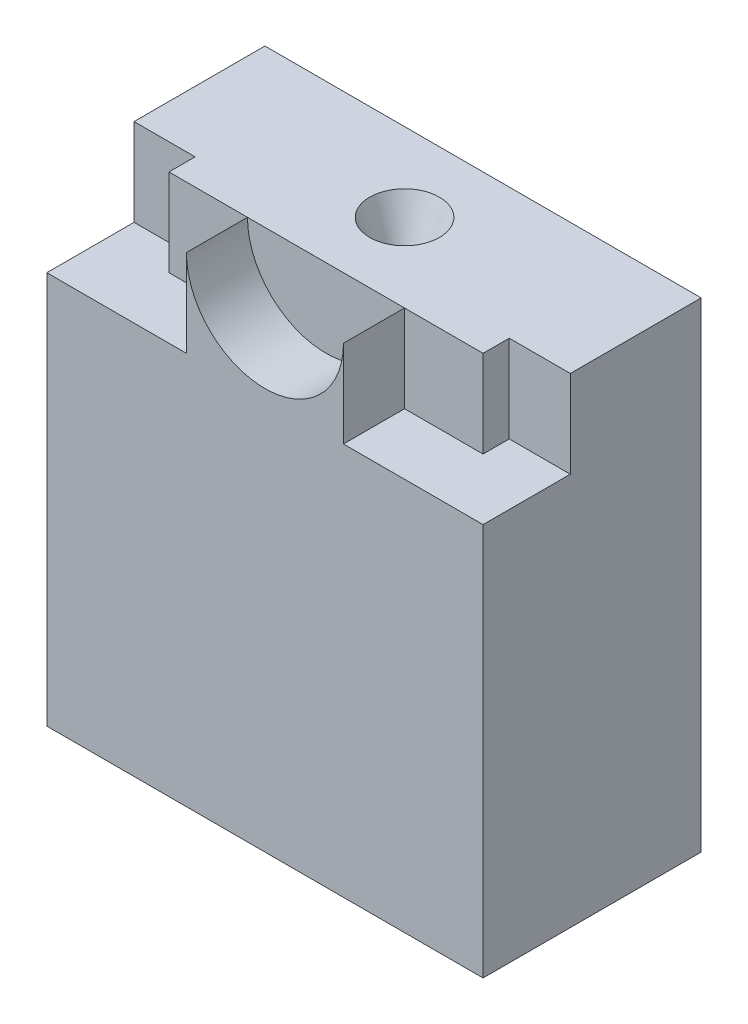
ISO-10303-21;
HEADER;
FILE_DESCRIPTION(('STEP AP214'),'2;1');
FILE_NAME('part.step','',(''),(''),'','','');
FILE_SCHEMA(('AUTOMOTIVE_DESIGN { 1 0 10303 214 1 1 1 1 }'));
ENDSEC;
DATA;
#1=APPLICATION_CONTEXT('core data for automotive mechanical design processes');
#2=APPLICATION_PROTOCOL_DEFINITION('international standard','automotive_design',2000,#1);
#3=PRODUCT_CONTEXT('',#1,'mechanical');
#4=PRODUCT('Part','Part','',(#3));
#5=PRODUCT_RELATED_PRODUCT_CATEGORY('part','',(#4));
#6=PRODUCT_DEFINITION_FORMATION('','',#4);
#7=PRODUCT_DEFINITION_CONTEXT('part definition',#1,'design');
#8=PRODUCT_DEFINITION('design','',#6,#7);
#9=PRODUCT_DEFINITION_SHAPE('','',#8);
#10=(LENGTH_UNIT() NAMED_UNIT(*) SI_UNIT(.MILLI.,.METRE.));
#11=(NAMED_UNIT(*) PLANE_ANGLE_UNIT() SI_UNIT($,.RADIAN.));
#12=(NAMED_UNIT(*) SI_UNIT($,.STERADIAN.) SOLID_ANGLE_UNIT());
#13=UNCERTAINTY_MEASURE_WITH_UNIT(LENGTH_MEASURE(1.E-05),#10,'distance_accuracy_value','');
#14=(GEOMETRIC_REPRESENTATION_CONTEXT(3) GLOBAL_UNCERTAINTY_ASSIGNED_CONTEXT((#13)) GLOBAL_UNIT_ASSIGNED_CONTEXT((#10,
#11,#12)) REPRESENTATION_CONTEXT('',''));
#15=CARTESIAN_POINT('',(0.,0.,0.));
#16=DIRECTION('',(0.,0.,1.));
#17=DIRECTION('',(1.,0.,0.));
#18=AXIS2_PLACEMENT_3D('',#15,#16,#17);
#19=CARTESIAN_POINT('',(-25.,55.,12.5));
#20=DIRECTION('',(0.,1.,0.));
#21=DIRECTION('',(0.,0.,1.));
#22=AXIS2_PLACEMENT_3D('',#19,#20,#21);
#23=PLANE('',#22);
#24=CARTESIAN_POINT('',(0.,55.,-3.5));
#25=DIRECTION('',(0.,-1.,0.));
#26=DIRECTION('',(0.,0.,-1.));
#27=AXIS2_PLACEMENT_3D('',#24,#25,#26);
#28=CIRCLE('',#27,4.);
#29=CARTESIAN_POINT('',(0.,55.,-7.5));
#30=VERTEX_POINT('',#29);
#31=EDGE_CURVE('E239',#30,#30,#28,.T.);
#32=ORIENTED_EDGE('',*,*,#31,.T.);
#33=EDGE_LOOP('',(#32));
#34=FACE_BOUND('',#33,.T.);
#35=DIRECTION('',(-1.,0.,0.));
#36=VECTOR('',#35,1.);
#37=CARTESIAN_POINT('',(-9.,55.,5.5));
#38=LINE('',#37,#36);
#39=CARTESIAN_POINT('',(-9.,55.,5.5));
#40=VERTEX_POINT('',#39);
#41=CARTESIAN_POINT('',(-18.,55.,5.5));
#42=VERTEX_POINT('',#41);
#43=EDGE_CURVE('E191',#40,#42,#38,.T.);
#44=ORIENTED_EDGE('',*,*,#43,.F.);
#45=DIRECTION('',(1.,0.,0.));
#46=VECTOR('',#45,1.);
#47=CARTESIAN_POINT('',(-25.,55.,5.5));
#48=LINE('',#47,#46);
#49=CARTESIAN_POINT('',(9.,55.,5.5));
#50=VERTEX_POINT('',#49);
#51=EDGE_CURVE('E234',#40,#50,#48,.T.);
#52=ORIENTED_EDGE('',*,*,#51,.T.);
#53=DIRECTION('',(-1.,0.,0.));
#54=VECTOR('',#53,1.);
#55=CARTESIAN_POINT('',(9.,55.,5.5));
#56=LINE('',#55,#54);
#57=CARTESIAN_POINT('',(18.,55.,5.5));
#58=VERTEX_POINT('',#57);
#59=EDGE_CURVE('E259',#58,#50,#56,.T.);
#60=ORIENTED_EDGE('',*,*,#59,.F.);
#61=DIRECTION('',(0.,0.,1.));
#62=VECTOR('',#61,1.);
#63=CARTESIAN_POINT('',(18.,55.,5.5));
#64=LINE('',#63,#62);
#65=CARTESIAN_POINT('',(18.,55.,2.5));
#66=VERTEX_POINT('',#65);
#67=EDGE_CURVE('E256',#66,#58,#64,.T.);
#68=ORIENTED_EDGE('',*,*,#67,.F.);
#69=DIRECTION('',(-1.,0.,0.));
#70=VECTOR('',#69,1.);
#71=CARTESIAN_POINT('',(18.,55.,2.5));
#72=LINE('',#71,#70);
#73=CARTESIAN_POINT('',(25.,55.,2.5));
#74=VERTEX_POINT('',#73);
#75=EDGE_CURVE('E203',#74,#66,#72,.T.);
#76=ORIENTED_EDGE('',*,*,#75,.F.);
#77=DIRECTION('',(0.,0.,-1.));
#78=VECTOR('',#77,1.);
#79=CARTESIAN_POINT('',(25.,55.,-12.5));
#80=LINE('',#79,#78);
#81=CARTESIAN_POINT('',(25.,55.,-12.5));
#82=VERTEX_POINT('',#81);
#83=EDGE_CURVE('E200',#74,#82,#80,.T.);
#84=ORIENTED_EDGE('',*,*,#83,.T.);
#85=DIRECTION('',(-1.,0.,0.));
#86=VECTOR('',#85,1.);
#87=CARTESIAN_POINT('',(-25.,55.,-12.5));
#88=LINE('',#87,#86);
#89=CARTESIAN_POINT('',(-25.,55.,-12.5));
#90=VERTEX_POINT('',#89);
#91=EDGE_CURVE('E55',#82,#90,#88,.T.);
#92=ORIENTED_EDGE('',*,*,#91,.T.);
#93=DIRECTION('',(0.,0.,1.));
#94=VECTOR('',#93,1.);
#95=CARTESIAN_POINT('',(-25.,55.,-12.5));
#96=LINE('',#95,#94);
#97=CARTESIAN_POINT('',(-25.,55.,2.5));
#98=VERTEX_POINT('',#97);
#99=EDGE_CURVE('E83',#90,#98,#96,.T.);
#100=ORIENTED_EDGE('',*,*,#99,.T.);
#101=DIRECTION('',(-1.,0.,0.));
#102=VECTOR('',#101,1.);
#103=CARTESIAN_POINT('',(-18.,55.,2.5));
#104=LINE('',#103,#102);
#105=CARTESIAN_POINT('',(-18.,55.,2.5));
#106=VERTEX_POINT('',#105);
#107=EDGE_CURVE('E148',#106,#98,#104,.T.);
#108=ORIENTED_EDGE('',*,*,#107,.F.);
#109=DIRECTION('',(0.,0.,-1.));
#110=VECTOR('',#109,1.);
#111=CARTESIAN_POINT('',(-18.,55.,5.5));
#112=LINE('',#111,#110);
#113=EDGE_CURVE('E173',#42,#106,#112,.T.);
#114=ORIENTED_EDGE('',*,*,#113,.F.);
#115=EDGE_LOOP('',(#44,#52,#60,#68,#76,#84,#92,#100,#108,#114));
#116=FACE_BOUND('',#115,.T.);
#117=ADVANCED_FACE('F31',(#34,#116),#23,.T.);
#118=CARTESIAN_POINT('',(-25.,55.,12.5));
#119=DIRECTION('',(0.,0.,-1.));
#120=DIRECTION('',(-1.,0.,0.));
#121=AXIS2_PLACEMENT_3D('',#118,#119,#120);
#122=PLANE('',#121);
#123=CARTESIAN_POINT('',(0.,55.,12.5));
#124=DIRECTION('',(0.,0.,-1.));
#125=DIRECTION('',(-1.,0.,0.));
#126=AXIS2_PLACEMENT_3D('',#123,#124,#125);
#127=CIRCLE('',#126,9.);
#128=CARTESIAN_POINT('',(9.,55.,12.5));
#129=VERTEX_POINT('',#128);
#130=CARTESIAN_POINT('',(-9.,55.,12.5));
#131=VERTEX_POINT('',#130);
#132=EDGE_CURVE('E226',#129,#131,#127,.T.);
#133=ORIENTED_EDGE('',*,*,#132,.T.);
#134=DIRECTION('',(0.,1.,0.));
#135=VECTOR('',#134,1.);
#136=CARTESIAN_POINT('',(-9.,45.,12.5));
#137=LINE('',#136,#135);
#138=CARTESIAN_POINT('',(-9.,45.,12.5));
#139=VERTEX_POINT('',#138);
#140=EDGE_CURVE('E97',#139,#131,#137,.T.);
#141=ORIENTED_EDGE('',*,*,#140,.F.);
#142=DIRECTION('',(1.,0.,0.));
#143=VECTOR('',#142,1.);
#144=CARTESIAN_POINT('',(-25.,45.,12.5));
#145=LINE('',#144,#143);
#146=CARTESIAN_POINT('',(-25.,45.,12.5));
#147=VERTEX_POINT('',#146);
#148=EDGE_CURVE('E123',#147,#139,#145,.T.);
#149=ORIENTED_EDGE('',*,*,#148,.F.);
#150=DIRECTION('',(0.,-1.,0.));
#151=VECTOR('',#150,1.);
#152=CARTESIAN_POINT('',(-25.,55.,12.5));
#153=LINE('',#152,#151);
#154=CARTESIAN_POINT('',(-25.,0.,12.5));
#155=VERTEX_POINT('',#154);
#156=EDGE_CURVE('E11',#147,#155,#153,.T.);
#157=ORIENTED_EDGE('',*,*,#156,.T.);
#158=DIRECTION('',(1.,0.,0.));
#159=VECTOR('',#158,1.);
#160=CARTESIAN_POINT('',(-25.,0.,12.5));
#161=LINE('',#160,#159);
#162=CARTESIAN_POINT('',(25.,0.,12.5));
#163=VERTEX_POINT('',#162);
#164=EDGE_CURVE('E96',#155,#163,#161,.T.);
#165=ORIENTED_EDGE('',*,*,#164,.T.);
#166=DIRECTION('',(0.,-1.,0.));
#167=VECTOR('',#166,1.);
#168=CARTESIAN_POINT('',(25.,55.,12.5));
#169=LINE('',#168,#167);
#170=CARTESIAN_POINT('',(25.,45.,12.5));
#171=VERTEX_POINT('',#170);
#172=EDGE_CURVE('E39',#171,#163,#169,.T.);
#173=ORIENTED_EDGE('',*,*,#172,.F.);
#174=DIRECTION('',(1.,0.,0.));
#175=VECTOR('',#174,1.);
#176=CARTESIAN_POINT('',(25.,45.,12.5));
#177=LINE('',#176,#175);
#178=CARTESIAN_POINT('',(9.,45.,12.5));
#179=VERTEX_POINT('',#178);
#180=EDGE_CURVE('E242',#179,#171,#177,.T.);
#181=ORIENTED_EDGE('',*,*,#180,.F.);
#182=DIRECTION('',(0.,1.,0.));
#183=VECTOR('',#182,1.);
#184=CARTESIAN_POINT('',(9.,45.,12.5));
#185=LINE('',#184,#183);
#186=EDGE_CURVE('E192',#179,#129,#185,.T.);
#187=ORIENTED_EDGE('',*,*,#186,.T.);
#188=EDGE_LOOP('',(#133,#141,#149,#157,#165,#173,#181,#187));
#189=FACE_BOUND('',#188,.T.);
#190=ADVANCED_FACE('F118',(#189),#122,.F.);
#191=CARTESIAN_POINT('',(-25.,55.,-12.5));
#192=DIRECTION('',(1.,0.,0.));
#193=DIRECTION('',(0.,0.,-1.));
#194=AXIS2_PLACEMENT_3D('',#191,#192,#193);
#195=PLANE('',#194);
#196=DIRECTION('',(0.,0.,1.));
#197=VECTOR('',#196,1.);
#198=CARTESIAN_POINT('',(-25.,45.,2.5));
#199=LINE('',#198,#197);
#200=CARTESIAN_POINT('',(-25.,45.,2.5));
#201=VERTEX_POINT('',#200);
#202=EDGE_CURVE('E126',#201,#147,#199,.T.);
#203=ORIENTED_EDGE('',*,*,#202,.F.);
#204=DIRECTION('',(0.,1.,0.));
#205=VECTOR('',#204,1.);
#206=CARTESIAN_POINT('',(-25.,45.,2.5));
#207=LINE('',#206,#205);
#208=EDGE_CURVE('E101',#201,#98,#207,.T.);
#209=ORIENTED_EDGE('',*,*,#208,.T.);
#210=ORIENTED_EDGE('',*,*,#99,.F.);
#211=DIRECTION('',(0.,-1.,0.));
#212=VECTOR('',#211,1.);
#213=CARTESIAN_POINT('',(-25.,55.,-12.5));
#214=LINE('',#213,#212);
#215=CARTESIAN_POINT('',(-25.,0.,-12.5));
#216=VERTEX_POINT('',#215);
#217=EDGE_CURVE('E76',#90,#216,#214,.T.);
#218=ORIENTED_EDGE('',*,*,#217,.T.);
#219=DIRECTION('',(0.,0.,1.));
#220=VECTOR('',#219,1.);
#221=CARTESIAN_POINT('',(-25.,0.,-12.5));
#222=LINE('',#221,#220);
#223=EDGE_CURVE('E90',#216,#155,#222,.T.);
#224=ORIENTED_EDGE('',*,*,#223,.T.);
#225=ORIENTED_EDGE('',*,*,#156,.F.);
#226=EDGE_LOOP('',(#203,#209,#210,#218,#224,#225));
#227=FACE_BOUND('',#226,.T.);
#228=ADVANCED_FACE('F33',(#227),#195,.F.);
#229=CARTESIAN_POINT('',(25.,55.,-12.5));
#230=DIRECTION('',(-1.,0.,0.));
#231=DIRECTION('',(0.,0.,1.));
#232=AXIS2_PLACEMENT_3D('',#229,#230,#231);
#233=PLANE('',#232);
#234=ORIENTED_EDGE('',*,*,#83,.F.);
#235=DIRECTION('',(0.,1.,0.));
#236=VECTOR('',#235,1.);
#237=CARTESIAN_POINT('',(25.,45.,2.5));
#238=LINE('',#237,#236);
#239=CARTESIAN_POINT('',(25.,45.,2.5));
#240=VERTEX_POINT('',#239);
#241=EDGE_CURVE('E46',#240,#74,#238,.T.);
#242=ORIENTED_EDGE('',*,*,#241,.F.);
#243=DIRECTION('',(0.,0.,-1.));
#244=VECTOR('',#243,1.);
#245=CARTESIAN_POINT('',(25.,45.,2.5));
#246=LINE('',#245,#244);
#247=EDGE_CURVE('E114',#171,#240,#246,.T.);
#248=ORIENTED_EDGE('',*,*,#247,.F.);
#249=ORIENTED_EDGE('',*,*,#172,.T.);
#250=DIRECTION('',(0.,0.,-1.));
#251=VECTOR('',#250,1.);
#252=CARTESIAN_POINT('',(25.,0.,-12.5));
#253=LINE('',#252,#251);
#254=CARTESIAN_POINT('',(25.,0.,-12.5));
#255=VERTEX_POINT('',#254);
#256=EDGE_CURVE('E84',#163,#255,#253,.T.);
#257=ORIENTED_EDGE('',*,*,#256,.T.);
#258=DIRECTION('',(0.,-1.,0.));
#259=VECTOR('',#258,1.);
#260=CARTESIAN_POINT('',(25.,55.,-12.5));
#261=LINE('',#260,#259);
#262=EDGE_CURVE('E79',#82,#255,#261,.T.);
#263=ORIENTED_EDGE('',*,*,#262,.F.);
#264=EDGE_LOOP('',(#234,#242,#248,#249,#257,#263));
#265=FACE_BOUND('',#264,.T.);
#266=ADVANCED_FACE('F111',(#265),#233,.F.);
#267=CARTESIAN_POINT('',(-25.,55.,-12.5));
#268=DIRECTION('',(0.,0.,1.));
#269=DIRECTION('',(1.,0.,0.));
#270=AXIS2_PLACEMENT_3D('',#267,#268,#269);
#271=PLANE('',#270);
#272=DIRECTION('',(-1.,0.,0.));
#273=VECTOR('',#272,1.);
#274=CARTESIAN_POINT('',(-25.,0.,-12.5));
#275=LINE('',#274,#273);
#276=EDGE_CURVE('E73',#255,#216,#275,.T.);
#277=ORIENTED_EDGE('',*,*,#276,.T.);
#278=ORIENTED_EDGE('',*,*,#217,.F.);
#279=ORIENTED_EDGE('',*,*,#91,.F.);
#280=ORIENTED_EDGE('',*,*,#262,.T.);
#281=EDGE_LOOP('',(#277,#278,#279,#280));
#282=FACE_BOUND('',#281,.T.);
#283=ADVANCED_FACE('F75',(#282),#271,.F.);
#284=CARTESIAN_POINT('',(-25.,0.,12.5));
#285=DIRECTION('',(0.,1.,0.));
#286=DIRECTION('',(0.,0.,1.));
#287=AXIS2_PLACEMENT_3D('',#284,#285,#286);
#288=PLANE('',#287);
#289=ORIENTED_EDGE('',*,*,#223,.F.);
#290=ORIENTED_EDGE('',*,*,#276,.F.);
#291=ORIENTED_EDGE('',*,*,#256,.F.);
#292=ORIENTED_EDGE('',*,*,#164,.F.);
#293=EDGE_LOOP('',(#289,#290,#291,#292));
#294=FACE_BOUND('',#293,.T.);
#295=ADVANCED_FACE('F94',(#294),#288,.F.);
#296=CARTESIAN_POINT('',(-9.,45.,12.5));
#297=DIRECTION('',(1.,0.,0.));
#298=DIRECTION('',(0.,0.,-1.));
#299=AXIS2_PLACEMENT_3D('',#296,#297,#298);
#300=PLANE('',#299);
#301=DIRECTION('',(0.,0.,-1.));
#302=VECTOR('',#301,1.);
#303=CARTESIAN_POINT('',(-9.,55.,12.5));
#304=LINE('',#303,#302);
#305=EDGE_CURVE('E189',#131,#40,#304,.T.);
#306=ORIENTED_EDGE('',*,*,#305,.T.);
#307=DIRECTION('',(0.,1.,0.));
#308=VECTOR('',#307,1.);
#309=CARTESIAN_POINT('',(-9.,45.,5.5));
#310=LINE('',#309,#308);
#311=CARTESIAN_POINT('',(-9.,45.,5.5));
#312=VERTEX_POINT('',#311);
#313=EDGE_CURVE('E155',#312,#40,#310,.T.);
#314=ORIENTED_EDGE('',*,*,#313,.F.);
#315=DIRECTION('',(0.,0.,-1.));
#316=VECTOR('',#315,1.);
#317=CARTESIAN_POINT('',(-9.,45.,12.5));
#318=LINE('',#317,#316);
#319=EDGE_CURVE('E183',#139,#312,#318,.T.);
#320=ORIENTED_EDGE('',*,*,#319,.F.);
#321=ORIENTED_EDGE('',*,*,#140,.T.);
#322=EDGE_LOOP('',(#306,#314,#320,#321));
#323=FACE_BOUND('',#322,.T.);
#324=ADVANCED_FACE('F217',(#323),#300,.F.);
#325=CARTESIAN_POINT('',(-18.,45.,2.5));
#326=DIRECTION('',(0.,0.,-1.));
#327=DIRECTION('',(-1.,0.,0.));
#328=AXIS2_PLACEMENT_3D('',#325,#326,#327);
#329=PLANE('',#328);
#330=ORIENTED_EDGE('',*,*,#107,.T.);
#331=ORIENTED_EDGE('',*,*,#208,.F.);
#332=DIRECTION('',(-1.,0.,0.));
#333=VECTOR('',#332,1.);
#334=CARTESIAN_POINT('',(-18.,45.,2.5));
#335=LINE('',#334,#333);
#336=CARTESIAN_POINT('',(-18.,45.,2.5));
#337=VERTEX_POINT('',#336);
#338=EDGE_CURVE('E176',#337,#201,#335,.T.);
#339=ORIENTED_EDGE('',*,*,#338,.F.);
#340=DIRECTION('',(0.,1.,0.));
#341=VECTOR('',#340,1.);
#342=CARTESIAN_POINT('',(-18.,45.,2.5));
#343=LINE('',#342,#341);
#344=EDGE_CURVE('E166',#337,#106,#343,.T.);
#345=ORIENTED_EDGE('',*,*,#344,.T.);
#346=EDGE_LOOP('',(#330,#331,#339,#345));
#347=FACE_BOUND('',#346,.T.);
#348=ADVANCED_FACE('F177',(#347),#329,.F.);
#349=CARTESIAN_POINT('',(-18.,45.,5.5));
#350=DIRECTION('',(1.,0.,0.));
#351=DIRECTION('',(0.,0.,-1.));
#352=AXIS2_PLACEMENT_3D('',#349,#350,#351);
#353=PLANE('',#352);
#354=ORIENTED_EDGE('',*,*,#113,.T.);
#355=ORIENTED_EDGE('',*,*,#344,.F.);
#356=DIRECTION('',(0.,0.,-1.));
#357=VECTOR('',#356,1.);
#358=CARTESIAN_POINT('',(-18.,45.,5.5));
#359=LINE('',#358,#357);
#360=CARTESIAN_POINT('',(-18.,45.,5.5));
#361=VERTEX_POINT('',#360);
#362=EDGE_CURVE('E170',#361,#337,#359,.T.);
#363=ORIENTED_EDGE('',*,*,#362,.F.);
#364=DIRECTION('',(0.,1.,0.));
#365=VECTOR('',#364,1.);
#366=CARTESIAN_POINT('',(-18.,45.,5.5));
#367=LINE('',#366,#365);
#368=EDGE_CURVE('E174',#361,#42,#367,.T.);
#369=ORIENTED_EDGE('',*,*,#368,.T.);
#370=EDGE_LOOP('',(#354,#355,#363,#369));
#371=FACE_BOUND('',#370,.T.);
#372=ADVANCED_FACE('F168',(#371),#353,.F.);
#373=CARTESIAN_POINT('',(-9.,45.,5.5));
#374=DIRECTION('',(0.,0.,-1.));
#375=DIRECTION('',(-1.,0.,0.));
#376=AXIS2_PLACEMENT_3D('',#373,#374,#375);
#377=PLANE('',#376);
#378=ORIENTED_EDGE('',*,*,#43,.T.);
#379=ORIENTED_EDGE('',*,*,#368,.F.);
#380=DIRECTION('',(-1.,0.,0.));
#381=VECTOR('',#380,1.);
#382=CARTESIAN_POINT('',(-9.,45.,5.5));
#383=LINE('',#382,#381);
#384=EDGE_CURVE('E181',#312,#361,#383,.T.);
#385=ORIENTED_EDGE('',*,*,#384,.F.);
#386=ORIENTED_EDGE('',*,*,#313,.T.);
#387=EDGE_LOOP('',(#378,#379,#385,#386));
#388=FACE_BOUND('',#387,.T.);
#389=ADVANCED_FACE('F349',(#388),#377,.F.);
#390=CARTESIAN_POINT('',(-9.,45.,12.5));
#391=DIRECTION('',(0.,-1.,0.));
#392=DIRECTION('',(0.,0.,-1.));
#393=AXIS2_PLACEMENT_3D('',#390,#391,#392);
#394=PLANE('',#393);
#395=ORIENTED_EDGE('',*,*,#319,.T.);
#396=ORIENTED_EDGE('',*,*,#384,.T.);
#397=ORIENTED_EDGE('',*,*,#362,.T.);
#398=ORIENTED_EDGE('',*,*,#338,.T.);
#399=ORIENTED_EDGE('',*,*,#202,.T.);
#400=ORIENTED_EDGE('',*,*,#148,.T.);
#401=EDGE_LOOP('',(#395,#396,#397,#398,#399,#400));
#402=FACE_BOUND('',#401,.T.);
#403=ADVANCED_FACE('F180',(#402),#394,.F.);
#404=CARTESIAN_POINT('',(9.,45.,12.5));
#405=DIRECTION('',(-1.,0.,0.));
#406=DIRECTION('',(0.,0.,1.));
#407=AXIS2_PLACEMENT_3D('',#404,#405,#406);
#408=PLANE('',#407);
#409=DIRECTION('',(0.,0.,1.));
#410=VECTOR('',#409,1.);
#411=CARTESIAN_POINT('',(9.,55.,12.5));
#412=LINE('',#411,#410);
#413=EDGE_CURVE('E245',#50,#129,#412,.T.);
#414=ORIENTED_EDGE('',*,*,#413,.T.);
#415=ORIENTED_EDGE('',*,*,#186,.F.);
#416=DIRECTION('',(0.,0.,1.));
#417=VECTOR('',#416,1.);
#418=CARTESIAN_POINT('',(9.,45.,12.5));
#419=LINE('',#418,#417);
#420=CARTESIAN_POINT('',(9.,45.,5.5));
#421=VERTEX_POINT('',#420);
#422=EDGE_CURVE('E208',#421,#179,#419,.T.);
#423=ORIENTED_EDGE('',*,*,#422,.F.);
#424=DIRECTION('',(0.,1.,0.));
#425=VECTOR('',#424,1.);
#426=CARTESIAN_POINT('',(9.,45.,5.5));
#427=LINE('',#426,#425);
#428=EDGE_CURVE('E264',#421,#50,#427,.T.);
#429=ORIENTED_EDGE('',*,*,#428,.T.);
#430=EDGE_LOOP('',(#414,#415,#423,#429));
#431=FACE_BOUND('',#430,.T.);
#432=ADVANCED_FACE('F286',(#431),#408,.F.);
#433=CARTESIAN_POINT('',(9.,45.,5.5));
#434=DIRECTION('',(0.,0.,-1.));
#435=DIRECTION('',(-1.,0.,0.));
#436=AXIS2_PLACEMENT_3D('',#433,#434,#435);
#437=PLANE('',#436);
#438=ORIENTED_EDGE('',*,*,#59,.T.);
#439=ORIENTED_EDGE('',*,*,#428,.F.);
#440=DIRECTION('',(-1.,0.,0.));
#441=VECTOR('',#440,1.);
#442=CARTESIAN_POINT('',(9.,45.,5.5));
#443=LINE('',#442,#441);
#444=CARTESIAN_POINT('',(18.,45.,5.5));
#445=VERTEX_POINT('',#444);
#446=EDGE_CURVE('E214',#445,#421,#443,.T.);
#447=ORIENTED_EDGE('',*,*,#446,.F.);
#448=DIRECTION('',(0.,1.,0.));
#449=VECTOR('',#448,1.);
#450=CARTESIAN_POINT('',(18.,45.,5.5));
#451=LINE('',#450,#449);
#452=EDGE_CURVE('E211',#445,#58,#451,.T.);
#453=ORIENTED_EDGE('',*,*,#452,.T.);
#454=EDGE_LOOP('',(#438,#439,#447,#453));
#455=FACE_BOUND('',#454,.T.);
#456=ADVANCED_FACE('F271',(#455),#437,.F.);
#457=CARTESIAN_POINT('',(18.,45.,5.5));
#458=DIRECTION('',(-1.,0.,0.));
#459=DIRECTION('',(0.,0.,1.));
#460=AXIS2_PLACEMENT_3D('',#457,#458,#459);
#461=PLANE('',#460);
#462=ORIENTED_EDGE('',*,*,#67,.T.);
#463=ORIENTED_EDGE('',*,*,#452,.F.);
#464=DIRECTION('',(0.,0.,1.));
#465=VECTOR('',#464,1.);
#466=CARTESIAN_POINT('',(18.,45.,5.5));
#467=LINE('',#466,#465);
#468=CARTESIAN_POINT('',(18.,45.,2.5));
#469=VERTEX_POINT('',#468);
#470=EDGE_CURVE('E250',#469,#445,#467,.T.);
#471=ORIENTED_EDGE('',*,*,#470,.F.);
#472=DIRECTION('',(0.,1.,0.));
#473=VECTOR('',#472,1.);
#474=CARTESIAN_POINT('',(18.,45.,2.5));
#475=LINE('',#474,#473);
#476=EDGE_CURVE('E207',#469,#66,#475,.T.);
#477=ORIENTED_EDGE('',*,*,#476,.T.);
#478=EDGE_LOOP('',(#462,#463,#471,#477));
#479=FACE_BOUND('',#478,.T.);
#480=ADVANCED_FACE('F278',(#479),#461,.F.);
#481=CARTESIAN_POINT('',(18.,45.,2.5));
#482=DIRECTION('',(0.,0.,-1.));
#483=DIRECTION('',(-1.,0.,0.));
#484=AXIS2_PLACEMENT_3D('',#481,#482,#483);
#485=PLANE('',#484);
#486=ORIENTED_EDGE('',*,*,#75,.T.);
#487=ORIENTED_EDGE('',*,*,#476,.F.);
#488=DIRECTION('',(-1.,0.,0.));
#489=VECTOR('',#488,1.);
#490=CARTESIAN_POINT('',(18.,45.,2.5));
#491=LINE('',#490,#489);
#492=EDGE_CURVE('E247',#240,#469,#491,.T.);
#493=ORIENTED_EDGE('',*,*,#492,.F.);
#494=ORIENTED_EDGE('',*,*,#241,.T.);
#495=EDGE_LOOP('',(#486,#487,#493,#494));
#496=FACE_BOUND('',#495,.T.);
#497=ADVANCED_FACE('F398',(#496),#485,.F.);
#498=CARTESIAN_POINT('',(9.,45.,12.5));
#499=DIRECTION('',(0.,-1.,0.));
#500=DIRECTION('',(0.,0.,-1.));
#501=AXIS2_PLACEMENT_3D('',#498,#499,#500);
#502=PLANE('',#501);
#503=ORIENTED_EDGE('',*,*,#180,.T.);
#504=ORIENTED_EDGE('',*,*,#247,.T.);
#505=ORIENTED_EDGE('',*,*,#492,.T.);
#506=ORIENTED_EDGE('',*,*,#470,.T.);
#507=ORIENTED_EDGE('',*,*,#446,.T.);
#508=ORIENTED_EDGE('',*,*,#422,.T.);
#509=EDGE_LOOP('',(#503,#504,#505,#506,#507,#508));
#510=FACE_BOUND('',#509,.T.);
#511=ADVANCED_FACE('F290',(#510),#502,.F.);
#512=CARTESIAN_POINT('',(0.,55.,-3.5));
#513=DIRECTION('',(0.,1.,0.));
#514=DIRECTION('',(0.,0.,1.));
#515=AXIS2_PLACEMENT_3D('',#512,#513,#514);
#516=CONICAL_SURFACE('',#515,4.,0.400770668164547);
#517=CARTESIAN_POINT('',(0.,45.5594013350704,-3.5));
#518=VERTEX_POINT('',#517);
#519=VERTEX_LOOP('',#518);
#520=FACE_BOUND('',#519,.T.);
#521=ORIENTED_EDGE('',*,*,#31,.F.);
#522=EDGE_LOOP('',(#521));
#523=FACE_BOUND('',#522,.T.);
#524=ADVANCED_FACE('F300',(#520,#523),#516,.F.);
#525=CARTESIAN_POINT('',(0.,55.,0.));
#526=DIRECTION('',(0.,0.,-1.));
#527=DIRECTION('',(-1.,0.,0.));
#528=AXIS2_PLACEMENT_3D('',#525,#526,#527);
#529=CYLINDRICAL_SURFACE('',#528,9.);
#530=ORIENTED_EDGE('',*,*,#305,.F.);
#531=ORIENTED_EDGE('',*,*,#132,.F.);
#532=ORIENTED_EDGE('',*,*,#413,.F.);
#533=CARTESIAN_POINT('',(0.,55.,5.5));
#534=DIRECTION('',(0.,0.,-1.));
#535=DIRECTION('',(-1.,0.,0.));
#536=AXIS2_PLACEMENT_3D('',#533,#534,#535);
#537=CIRCLE('',#536,9.);
#538=EDGE_CURVE('E231',#50,#40,#537,.T.);
#539=ORIENTED_EDGE('',*,*,#538,.T.);
#540=EDGE_LOOP('',(#530,#531,#532,#539));
#541=FACE_BOUND('',#540,.T.);
#542=ADVANCED_FACE('F303',(#541),#529,.F.);
#543=CARTESIAN_POINT('',(0.,55.,5.5));
#544=DIRECTION('',(0.,0.,1.));
#545=DIRECTION('',(1.,0.,0.));
#546=AXIS2_PLACEMENT_3D('',#543,#544,#545);
#547=PLANE('',#546);
#548=ORIENTED_EDGE('',*,*,#538,.F.);
#549=ORIENTED_EDGE('',*,*,#51,.F.);
#550=EDGE_LOOP('',(#548,#549));
#551=FACE_BOUND('',#550,.T.);
#552=ADVANCED_FACE('F384',(#551),#547,.T.);
#553=CLOSED_SHELL('',(#117,#190,#228,#266,#283,#295,#324,#348,#372,#389,#403,#432,#456,#480,
#497,#511,#524,#542,#552));
#554=MANIFOLD_SOLID_BREP('B2',#553);
#555=ADVANCED_BREP_SHAPE_REPRESENTATION('',(#18,#554),#14);
#556=SHAPE_DEFINITION_REPRESENTATION(#9,#555);
ENDSEC;
END-ISO-10303-21;
